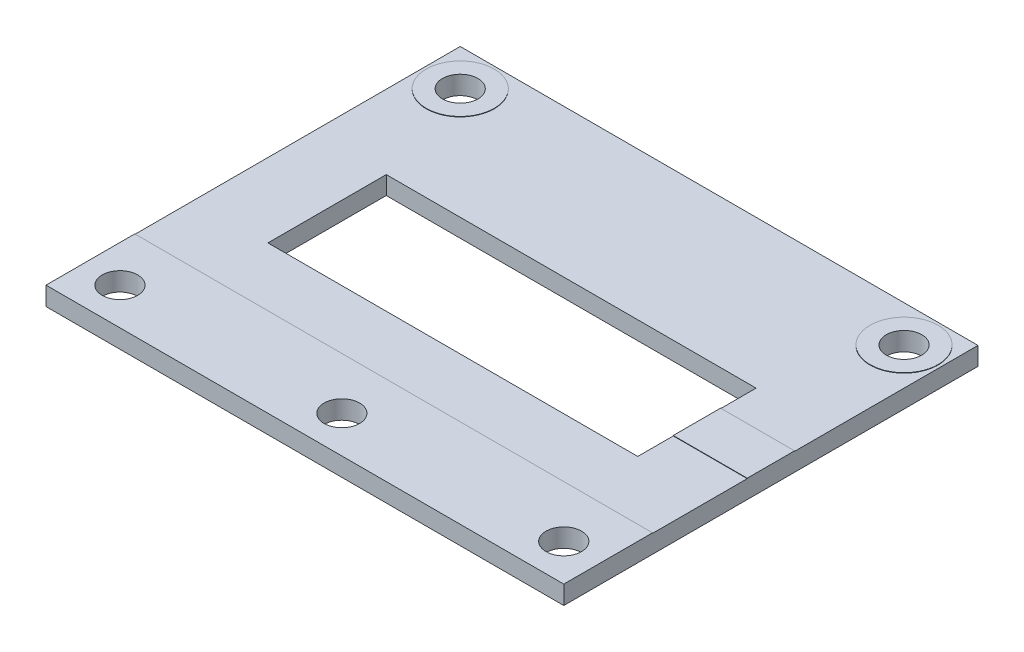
from build123d import *

# Parameters (mm, degrees)
SKETCH1_W           = 44.45
SKETCH1_H           = 35.56
BOSS_EXTRUDE1_DEPTH = 1.524
SKETCH2_R           = 2.921
SKETCH2_W           = 44.45
SKETCH2_H           = 7.62
BOSS_EXTRUDE2_DEPTH = 0.03556
SKETCH3_W           = 44.45
SKETCH3_H           = 35.56
BOSS_EXTRUDE3_DEPTH = 0.03556
SKETCH4_W           = 31.75
SKETCH4_H           = 10.16
CUT_EXTRUDE1_DEPTH  = 29.504583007
SKETCH5_R           = 1.524
CUT_EXTRUDE4_DEPTH  = 29.5065507
SKETCH6_W           = 6.35
SKETCH6_H           = 4.064
BOSS_EXTRUDE4_DEPTH = 0.03556


with BuildPart() as part:
    # Sketch1 → Boss-Extrude1 (new body)
    with BuildSketch(Plane(origin=(0, 0, 0), x_dir=(1, 0, 0), z_dir=(0, 1, 0))):
        Rectangle(SKETCH1_W, SKETCH1_H)
    extrude(amount=BOSS_EXTRUDE1_DEPTH)

    # Sketch2 → Boss-Extrude2 (add)
    with BuildSketch(Plane(origin=(0, 1.524, 0), x_dir=(1, 0, 0), z_dir=(0, 1, 0))):
        with Locations(Location((-19.05, 14.605, 0), (0, 0, 90))):
            Circle(SKETCH2_R)
        with Locations(Location((19.05, 14.605, 0), (0, 0, 90))):
            Circle(SKETCH2_R)
        with Locations((0, -13.97)):
            Rectangle(SKETCH2_W, SKETCH2_H)
    extrude(amount=BOSS_EXTRUDE2_DEPTH)

    # Sketch3 → Boss-Extrude3 (add)
    with BuildSketch(Plane.XZ):
        Rectangle(SKETCH3_W, SKETCH3_H)
    extrude(amount=BOSS_EXTRUDE3_DEPTH)

    # Sketch4 → Cut-Extrude1 (cut, through all)
    with BuildSketch(Plane(origin=(0, 1.524, 0), x_dir=(1, 0, 0), z_dir=(0, 1, 0))):
        Rectangle(SKETCH4_W, SKETCH4_H)
    extrude(amount=-CUT_EXTRUDE1_DEPTH, mode=Mode.SUBTRACT)

    # Sketch5 → Cut-Extrude4 (cut, through all)
    with BuildSketch(Plane(origin=(0, 1.55956, 0), x_dir=(1, 0, 0), z_dir=(0, 1, 0))):
        with Locations(Location((-19.05, 14.605, 0), (0, 0, 270))):
            Circle(SKETCH5_R)
        with Locations(Location((19.05, 14.605, 0), (0, 0, 270))):
            Circle(SKETCH5_R)
        with Locations(Location((-19.05, -14.605, 0), (0, 0, 270))):
            Circle(SKETCH5_R)
        with Locations(Location((19.05, -14.605, 0), (0, 0, 270))):
            Circle(SKETCH5_R)
        with Locations(Location((0, -14.605, 0), (0, 0, 270))):
            Circle(SKETCH5_R)
    extrude(amount=-CUT_EXTRUDE4_DEPTH, mode=Mode.SUBTRACT)

    # Sketch6 → Boss-Extrude4 (add)
    with BuildSketch(Plane(origin=(0, 1.524, 0), x_dir=(1, 0, 0), z_dir=(0, 1, 0))):
        with Locations((19.05, 0)):
            Rectangle(SKETCH6_W, SKETCH6_H)
    extrude(amount=BOSS_EXTRUDE4_DEPTH)


solid = part.part
